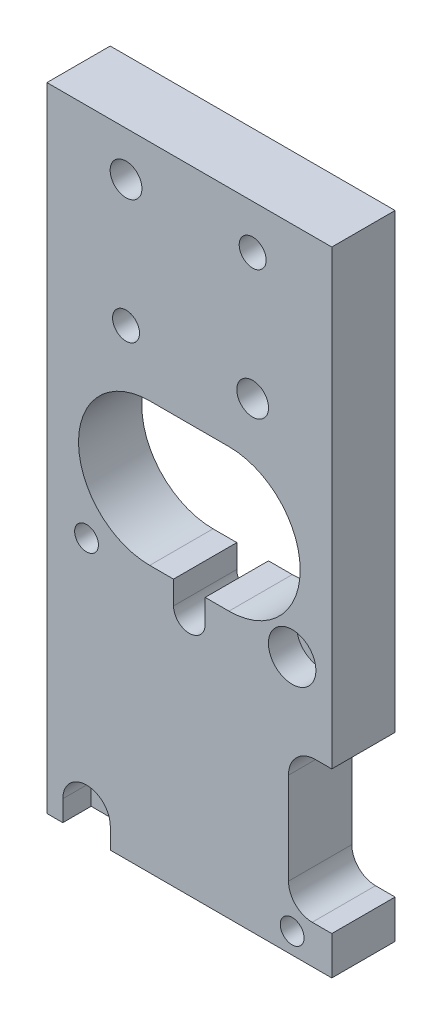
from build123d import *

# Parameters (mm, degrees)
SKETCH1_W             = 28.575
SKETCH1_H             = 63.5
EXTRUDE1_DEPTH        = 6.35
SKETCH2_R             = 1.59385
SKETCH2_R_2           = 1.5875
SKETCH2_R_3           = 1.1938
SKETCH2_R_4           = 1.4351
CUT_EXTRUDE1_DEPTH    = 36.390926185
CUT_EXTRUDE4_DEPTH    = 36.390926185
SKETCH4_R             = 2.38125
CUT_EXTRUDE5_DEPTH    = 2.8448
F_6_32_TAPPED_HOLE1_D = 2.7051
CUT_EXTRUDE6_DEPTH    = 36.390926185


with BuildPart() as part:
    # Sketch1 → Extrude1 (new body)
    with BuildSketch(Plane.XY):
        Rectangle(SKETCH1_W, SKETCH1_H)
    extrude(amount=-EXTRUDE1_DEPTH)

    # Sketch2 → Cut-Extrude1 (cut, through all)
    with BuildSketch(Plane.XY):
        with Locations((-6.35, 27.305)):
            Circle(SKETCH2_R)
        with Locations((6.35, 14.605)):
            Circle(SKETCH2_R)
        with Locations((0, -7.366)):
            Circle(SKETCH2_R_2)
        with Locations((-10.3124, -5.842)):
            Circle(SKETCH2_R_3)
        with Locations((10.3124, -29.6672)):
            Circle(SKETCH2_R_3)
        with Locations((10.3124, -5.842)):
            Circle(SKETCH2_R_4)
        with Locations((-10.3124, -29.6672)):
            Circle(SKETCH2_R_4)
    extrude(amount=-CUT_EXTRUDE1_DEPTH, mode=Mode.SUBTRACT)

    # Sketch3 → Cut-Extrude4 (cut, through all)
    with BuildSketch(Plane.XY):
        with BuildLine():
            Line((-3.9751, 9.25195), (3.9751, 9.25195))
            ThreePointArc((3.9751, 9.25195), (11.11885, 2.1082), (3.9751, -5.03555))
            Line((3.9751, -5.03555), (1.5875, -5.03555))
            Line((1.5875, -5.03555), (1.5875, -7.366))
            Line((1.5875, -7.366), (-1.5875, -7.366))
            Line((-1.5875, -7.366), (-1.5875, -5.03555))
            Line((-1.5875, -5.03555), (-3.9751, -5.03555))
            ThreePointArc((-3.9751, -5.03555), (-11.11885, 2.1082), (-3.9751, 9.25195))
        make_face()
    extrude(amount=-CUT_EXTRUDE4_DEPTH, mode=Mode.SUBTRACT)

    # Sketch4 → Cut-Extrude5 (cut)
    with BuildSketch(Plane.XY):
        with Locations((10.3124, -5.842)):
            Circle(SKETCH4_R)
        with BuildLine():
            Line((-12.69365, -29.6672), (-12.69365, -31.75))
            Line((-12.69365, -31.75), (-7.93115, -31.75))
            Line((-7.93115, -31.75), (-7.93115, -29.6672))
            ThreePointArc((-7.93115, -29.6672), (-10.3124, -27.28595), (-12.69365, -29.6672))
        make_face()
    extrude(amount=-CUT_EXTRUDE5_DEPTH, mode=Mode.SUBTRACT)

    # 6-32 Tapped Hole1 (through all)
    with Locations(Plane.XY):
        with Locations((-6.35, 14.605), (6.35, 27.305)):
            Hole(F_6_32_TAPPED_HOLE1_D / 2)

    # Sketch7 → Cut-Extrude6 (cut, through all)
    with BuildSketch(Plane.XY):
        with BuildLine():
            Line((14.2875, -13.589), (12.660987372, -13.589))
            ThreePointArc((12.660987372, -13.589), (10.740063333, -14.382570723), (9.9441, -16.302504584))
            Line((9.9441, -16.302504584), (9.9441, -25.50922))
            ThreePointArc((9.9441, -25.50922), (10.641180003, -27.192119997), (12.32408, -27.8892))
            Line((12.32408, -27.8892), (14.2875, -27.8892))
            Line((14.2875, -27.8892), (14.2875, -13.589))
        make_face()
    extrude(amount=-CUT_EXTRUDE6_DEPTH, mode=Mode.SUBTRACT)


solid = part.part
